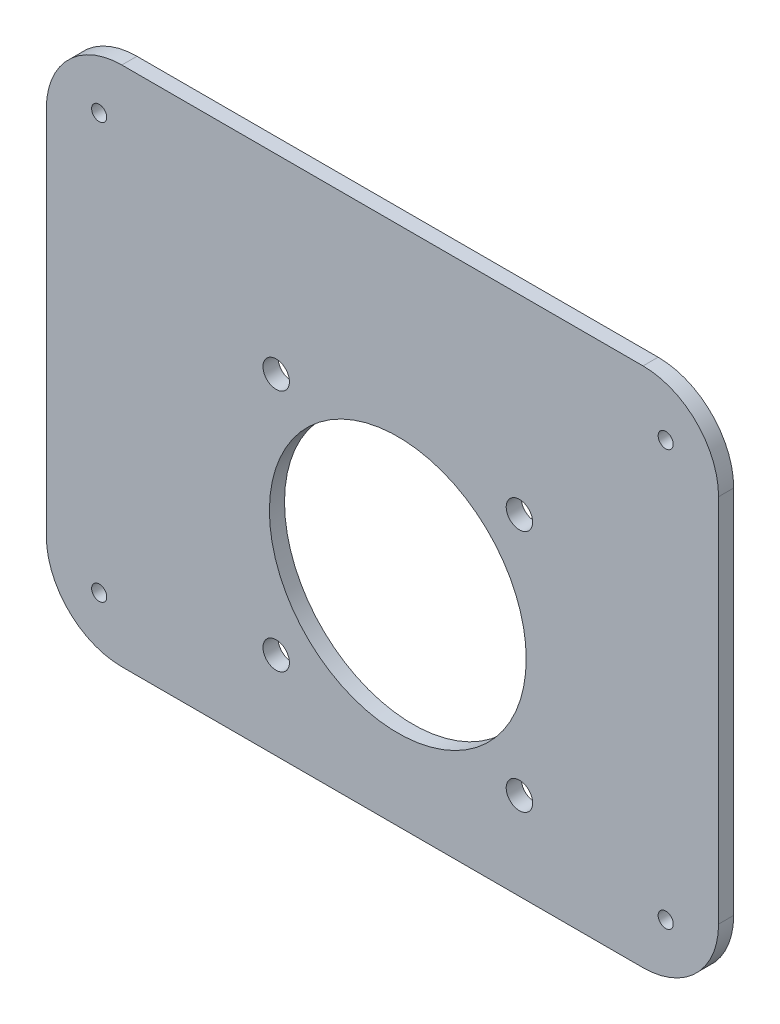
ISO-10303-21;
HEADER;
FILE_DESCRIPTION(('STEP AP214'),'2;1');
FILE_NAME('part.step','',(''),(''),'','','');
FILE_SCHEMA(('AUTOMOTIVE_DESIGN { 1 0 10303 214 1 1 1 1 }'));
ENDSEC;
DATA;
#1=APPLICATION_CONTEXT('core data for automotive mechanical design processes');
#2=APPLICATION_PROTOCOL_DEFINITION('international standard','automotive_design',2000,#1);
#3=PRODUCT_CONTEXT('',#1,'mechanical');
#4=PRODUCT('Part','Part','',(#3));
#5=PRODUCT_RELATED_PRODUCT_CATEGORY('part','',(#4));
#6=PRODUCT_DEFINITION_FORMATION('','',#4);
#7=PRODUCT_DEFINITION_CONTEXT('part definition',#1,'design');
#8=PRODUCT_DEFINITION('design','',#6,#7);
#9=PRODUCT_DEFINITION_SHAPE('','',#8);
#10=(LENGTH_UNIT() NAMED_UNIT(*) SI_UNIT(.MILLI.,.METRE.));
#11=(NAMED_UNIT(*) PLANE_ANGLE_UNIT() SI_UNIT($,.RADIAN.));
#12=(NAMED_UNIT(*) SI_UNIT($,.STERADIAN.) SOLID_ANGLE_UNIT());
#13=UNCERTAINTY_MEASURE_WITH_UNIT(LENGTH_MEASURE(1.E-05),#10,'distance_accuracy_value','');
#14=(GEOMETRIC_REPRESENTATION_CONTEXT(3) GLOBAL_UNCERTAINTY_ASSIGNED_CONTEXT((#13)) GLOBAL_UNIT_ASSIGNED_CONTEXT((#10,
#11,#12)) REPRESENTATION_CONTEXT('',''));
#15=CARTESIAN_POINT('',(0.,0.,0.));
#16=DIRECTION('',(0.,0.,1.));
#17=DIRECTION('',(1.,0.,0.));
#18=AXIS2_PLACEMENT_3D('',#15,#16,#17);
#19=CARTESIAN_POINT('',(79.,-59.,-2.));
#20=DIRECTION('',(0.,0.,1.));
#21=DIRECTION('',(1.,0.,0.));
#22=AXIS2_PLACEMENT_3D('',#19,#20,#21);
#23=CYLINDRICAL_SURFACE('',#22,9.99999999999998);
#24=CARTESIAN_POINT('',(79.,-59.,0.));
#25=DIRECTION('',(0.,0.,1.));
#26=DIRECTION('',(1.,0.,0.));
#27=AXIS2_PLACEMENT_3D('',#24,#25,#26);
#28=CIRCLE('',#27,9.99999999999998);
#29=CARTESIAN_POINT('',(79.,-69.,0.));
#30=VERTEX_POINT('',#29);
#31=CARTESIAN_POINT('',(89.,-59.,0.));
#32=VERTEX_POINT('',#31);
#33=EDGE_CURVE('E146',#30,#32,#28,.T.);
#34=ORIENTED_EDGE('',*,*,#33,.F.);
#35=DIRECTION('',(0.,0.,1.));
#36=VECTOR('',#35,1.);
#37=CARTESIAN_POINT('',(79.,-69.,-2.));
#38=LINE('',#37,#36);
#39=CARTESIAN_POINT('',(79.,-69.,-2.));
#40=VERTEX_POINT('',#39);
#41=EDGE_CURVE('E11',#40,#30,#38,.T.);
#42=ORIENTED_EDGE('',*,*,#41,.F.);
#43=CARTESIAN_POINT('',(79.,-59.,-2.));
#44=DIRECTION('',(0.,0.,1.));
#45=DIRECTION('',(1.,0.,0.));
#46=AXIS2_PLACEMENT_3D('',#43,#44,#45);
#47=CIRCLE('',#46,9.99999999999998);
#48=CARTESIAN_POINT('',(89.,-59.,-2.));
#49=VERTEX_POINT('',#48);
#50=EDGE_CURVE('E177',#40,#49,#47,.T.);
#51=ORIENTED_EDGE('',*,*,#50,.T.);
#52=DIRECTION('',(0.,0.,1.));
#53=VECTOR('',#52,1.);
#54=CARTESIAN_POINT('',(89.,-59.,-2.));
#55=LINE('',#54,#53);
#56=EDGE_CURVE('E40',#49,#32,#55,.T.);
#57=ORIENTED_EDGE('',*,*,#56,.T.);
#58=EDGE_LOOP('',(#34,#42,#51,#57));
#59=FACE_BOUND('',#58,.T.);
#60=ADVANCED_FACE('F37',(#59),#23,.T.);
#61=CARTESIAN_POINT('',(0.,-69.,-2.));
#62=DIRECTION('',(0.,-1.,0.));
#63=DIRECTION('',(0.,0.,-1.));
#64=AXIS2_PLACEMENT_3D('',#61,#62,#63);
#65=PLANE('',#64);
#66=DIRECTION('',(1.,0.,0.));
#67=VECTOR('',#66,1.);
#68=CARTESIAN_POINT('',(0.,-69.,0.));
#69=LINE('',#68,#67);
#70=CARTESIAN_POINT('',(10.0000000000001,-69.,0.));
#71=VERTEX_POINT('',#70);
#72=EDGE_CURVE('E163',#71,#30,#69,.T.);
#73=ORIENTED_EDGE('',*,*,#72,.F.);
#74=DIRECTION('',(0.,0.,1.));
#75=VECTOR('',#74,1.);
#76=CARTESIAN_POINT('',(10.0000000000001,-69.,-2.));
#77=LINE('',#76,#75);
#78=CARTESIAN_POINT('',(10.0000000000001,-69.,-2.));
#79=VERTEX_POINT('',#78);
#80=EDGE_CURVE('E46',#79,#71,#77,.T.);
#81=ORIENTED_EDGE('',*,*,#80,.F.);
#82=DIRECTION('',(1.,0.,0.));
#83=VECTOR('',#82,1.);
#84=CARTESIAN_POINT('',(0.,-69.,-2.));
#85=LINE('',#84,#83);
#86=EDGE_CURVE('E124',#79,#40,#85,.T.);
#87=ORIENTED_EDGE('',*,*,#86,.T.);
#88=ORIENTED_EDGE('',*,*,#41,.T.);
#89=EDGE_LOOP('',(#73,#81,#87,#88));
#90=FACE_BOUND('',#89,.T.);
#91=ADVANCED_FACE('F195',(#90),#65,.T.);
#92=CARTESIAN_POINT('',(10.,-59.,-2.));
#93=DIRECTION('',(0.,0.,1.));
#94=DIRECTION('',(1.,0.,0.));
#95=AXIS2_PLACEMENT_3D('',#92,#93,#94);
#96=CYLINDRICAL_SURFACE('',#95,10.);
#97=CARTESIAN_POINT('',(10.,-59.,0.));
#98=DIRECTION('',(0.,0.,1.));
#99=DIRECTION('',(1.,0.,0.));
#100=AXIS2_PLACEMENT_3D('',#97,#98,#99);
#101=CIRCLE('',#100,10.);
#102=CARTESIAN_POINT('',(0.,-58.9999999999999,0.));
#103=VERTEX_POINT('',#102);
#104=EDGE_CURVE('E111',#103,#71,#101,.T.);
#105=ORIENTED_EDGE('',*,*,#104,.F.);
#106=DIRECTION('',(0.,0.,1.));
#107=VECTOR('',#106,1.);
#108=CARTESIAN_POINT('',(0.,-58.9999999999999,-2.));
#109=LINE('',#108,#107);
#110=CARTESIAN_POINT('',(0.,-58.9999999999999,-2.));
#111=VERTEX_POINT('',#110);
#112=EDGE_CURVE('E106',#111,#103,#109,.T.);
#113=ORIENTED_EDGE('',*,*,#112,.F.);
#114=CARTESIAN_POINT('',(10.,-59.,-2.));
#115=DIRECTION('',(0.,0.,1.));
#116=DIRECTION('',(1.,0.,0.));
#117=AXIS2_PLACEMENT_3D('',#114,#115,#116);
#118=CIRCLE('',#117,10.);
#119=EDGE_CURVE('E109',#111,#79,#118,.T.);
#120=ORIENTED_EDGE('',*,*,#119,.T.);
#121=ORIENTED_EDGE('',*,*,#80,.T.);
#122=EDGE_LOOP('',(#105,#113,#120,#121));
#123=FACE_BOUND('',#122,.T.);
#124=ADVANCED_FACE('F108',(#123),#96,.T.);
#125=CARTESIAN_POINT('',(0.,0.,-2.));
#126=DIRECTION('',(-1.,0.,0.));
#127=DIRECTION('',(0.,-1.,0.));
#128=AXIS2_PLACEMENT_3D('',#125,#126,#127);
#129=PLANE('',#128);
#130=DIRECTION('',(0.,-1.,0.));
#131=VECTOR('',#130,1.);
#132=CARTESIAN_POINT('',(0.,0.,0.));
#133=LINE('',#132,#131);
#134=CARTESIAN_POINT('',(0.,-10.0000000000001,0.));
#135=VERTEX_POINT('',#134);
#136=EDGE_CURVE('E160',#135,#103,#133,.T.);
#137=ORIENTED_EDGE('',*,*,#136,.F.);
#138=DIRECTION('',(0.,0.,1.));
#139=VECTOR('',#138,1.);
#140=CARTESIAN_POINT('',(0.,-10.0000000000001,-2.));
#141=LINE('',#140,#139);
#142=CARTESIAN_POINT('',(0.,-10.0000000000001,-2.));
#143=VERTEX_POINT('',#142);
#144=EDGE_CURVE('E116',#143,#135,#141,.T.);
#145=ORIENTED_EDGE('',*,*,#144,.F.);
#146=DIRECTION('',(0.,-1.,0.));
#147=VECTOR('',#146,1.);
#148=CARTESIAN_POINT('',(0.,0.,-2.));
#149=LINE('',#148,#147);
#150=EDGE_CURVE('E122',#143,#111,#149,.T.);
#151=ORIENTED_EDGE('',*,*,#150,.T.);
#152=ORIENTED_EDGE('',*,*,#112,.T.);
#153=EDGE_LOOP('',(#137,#145,#151,#152));
#154=FACE_BOUND('',#153,.T.);
#155=ADVANCED_FACE('F126',(#154),#129,.T.);
#156=CARTESIAN_POINT('',(10.,-10.,-2.));
#157=DIRECTION('',(0.,0.,1.));
#158=DIRECTION('',(1.,0.,0.));
#159=AXIS2_PLACEMENT_3D('',#156,#157,#158);
#160=CYLINDRICAL_SURFACE('',#159,10.);
#161=CARTESIAN_POINT('',(10.,-10.,0.));
#162=DIRECTION('',(0.,0.,1.));
#163=DIRECTION('',(1.,0.,0.));
#164=AXIS2_PLACEMENT_3D('',#161,#162,#163);
#165=CIRCLE('',#164,10.);
#166=CARTESIAN_POINT('',(10.0000000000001,0.,0.));
#167=VERTEX_POINT('',#166);
#168=EDGE_CURVE('E157',#167,#135,#165,.T.);
#169=ORIENTED_EDGE('',*,*,#168,.F.);
#170=DIRECTION('',(0.,0.,1.));
#171=VECTOR('',#170,1.);
#172=CARTESIAN_POINT('',(10.0000000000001,0.,-2.));
#173=LINE('',#172,#171);
#174=CARTESIAN_POINT('',(10.0000000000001,0.,-2.));
#175=VERTEX_POINT('',#174);
#176=EDGE_CURVE('E181',#175,#167,#173,.T.);
#177=ORIENTED_EDGE('',*,*,#176,.F.);
#178=CARTESIAN_POINT('',(10.,-10.,-2.));
#179=DIRECTION('',(0.,0.,1.));
#180=DIRECTION('',(1.,0.,0.));
#181=AXIS2_PLACEMENT_3D('',#178,#179,#180);
#182=CIRCLE('',#181,10.);
#183=EDGE_CURVE('E127',#175,#143,#182,.T.);
#184=ORIENTED_EDGE('',*,*,#183,.T.);
#185=ORIENTED_EDGE('',*,*,#144,.T.);
#186=EDGE_LOOP('',(#169,#177,#184,#185));
#187=FACE_BOUND('',#186,.T.);
#188=ADVANCED_FACE('F209',(#187),#160,.T.);
#189=CARTESIAN_POINT('',(0.,0.,-2.));
#190=DIRECTION('',(0.,-1.,0.));
#191=DIRECTION('',(1.,0.,0.));
#192=AXIS2_PLACEMENT_3D('',#189,#190,#191);
#193=PLANE('',#192);
#194=DIRECTION('',(1.,0.,0.));
#195=VECTOR('',#194,1.);
#196=CARTESIAN_POINT('',(0.,0.,0.));
#197=LINE('',#196,#195);
#198=CARTESIAN_POINT('',(79.,0.,0.));
#199=VERTEX_POINT('',#198);
#200=EDGE_CURVE('E155',#167,#199,#197,.T.);
#201=ORIENTED_EDGE('',*,*,#200,.T.);
#202=DIRECTION('',(0.,0.,1.));
#203=VECTOR('',#202,1.);
#204=CARTESIAN_POINT('',(79.,0.,-2.));
#205=LINE('',#204,#203);
#206=CARTESIAN_POINT('',(79.,0.,-2.));
#207=VERTEX_POINT('',#206);
#208=EDGE_CURVE('E183',#207,#199,#205,.T.);
#209=ORIENTED_EDGE('',*,*,#208,.F.);
#210=DIRECTION('',(1.,0.,0.));
#211=VECTOR('',#210,1.);
#212=CARTESIAN_POINT('',(0.,0.,-2.));
#213=LINE('',#212,#211);
#214=EDGE_CURVE('E129',#175,#207,#213,.T.);
#215=ORIENTED_EDGE('',*,*,#214,.F.);
#216=ORIENTED_EDGE('',*,*,#176,.T.);
#217=EDGE_LOOP('',(#201,#209,#215,#216));
#218=FACE_BOUND('',#217,.T.);
#219=ADVANCED_FACE('F212',(#218),#193,.F.);
#220=CARTESIAN_POINT('',(79.,-10.,-2.));
#221=DIRECTION('',(0.,0.,1.));
#222=DIRECTION('',(1.,0.,0.));
#223=AXIS2_PLACEMENT_3D('',#220,#221,#222);
#224=CYLINDRICAL_SURFACE('',#223,9.99999999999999);
#225=CARTESIAN_POINT('',(79.,-10.,0.));
#226=DIRECTION('',(0.,0.,1.));
#227=DIRECTION('',(1.,0.,0.));
#228=AXIS2_PLACEMENT_3D('',#225,#226,#227);
#229=CIRCLE('',#228,9.99999999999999);
#230=CARTESIAN_POINT('',(89.,-10.,0.));
#231=VERTEX_POINT('',#230);
#232=EDGE_CURVE('E153',#199,#231,#229,.F.);
#233=ORIENTED_EDGE('',*,*,#232,.T.);
#234=DIRECTION('',(0.,0.,1.));
#235=VECTOR('',#234,1.);
#236=CARTESIAN_POINT('',(89.,-10.,-2.));
#237=LINE('',#236,#235);
#238=CARTESIAN_POINT('',(89.,-10.,-2.));
#239=VERTEX_POINT('',#238);
#240=EDGE_CURVE('E185',#239,#231,#237,.T.);
#241=ORIENTED_EDGE('',*,*,#240,.F.);
#242=CARTESIAN_POINT('',(79.,-10.,-2.));
#243=DIRECTION('',(0.,0.,1.));
#244=DIRECTION('',(1.,0.,0.));
#245=AXIS2_PLACEMENT_3D('',#242,#243,#244);
#246=CIRCLE('',#245,9.99999999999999);
#247=EDGE_CURVE('E315',#207,#239,#246,.F.);
#248=ORIENTED_EDGE('',*,*,#247,.F.);
#249=ORIENTED_EDGE('',*,*,#208,.T.);
#250=EDGE_LOOP('',(#233,#241,#248,#249));
#251=FACE_BOUND('',#250,.T.);
#252=ADVANCED_FACE('F216',(#251),#224,.T.);
#253=CARTESIAN_POINT('',(82.,-7.00000000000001,-2.));
#254=DIRECTION('',(0.,0.,1.));
#255=DIRECTION('',(1.,0.,0.));
#256=AXIS2_PLACEMENT_3D('',#253,#254,#255);
#257=CYLINDRICAL_SURFACE('',#256,0.999999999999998);
#258=CARTESIAN_POINT('',(82.,-7.00000000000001,-2.));
#259=DIRECTION('',(0.,0.,1.));
#260=DIRECTION('',(1.,0.,0.));
#261=AXIS2_PLACEMENT_3D('',#258,#259,#260);
#262=CIRCLE('',#261,0.999999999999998);
#263=CARTESIAN_POINT('',(83.,-7.00000000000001,-2.));
#264=VERTEX_POINT('',#263);
#265=EDGE_CURVE('E140',#264,#264,#262,.F.);
#266=ORIENTED_EDGE('',*,*,#265,.T.);
#267=EDGE_LOOP('',(#266));
#268=FACE_BOUND('',#267,.T.);
#269=CARTESIAN_POINT('',(82.,-7.00000000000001,0.));
#270=DIRECTION('',(0.,0.,1.));
#271=DIRECTION('',(1.,0.,0.));
#272=AXIS2_PLACEMENT_3D('',#269,#270,#271);
#273=CIRCLE('',#272,0.999999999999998);
#274=CARTESIAN_POINT('',(83.,-7.00000000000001,0.));
#275=VERTEX_POINT('',#274);
#276=EDGE_CURVE('E172',#275,#275,#273,.F.);
#277=ORIENTED_EDGE('',*,*,#276,.F.);
#278=EDGE_LOOP('',(#277));
#279=FACE_BOUND('',#278,.T.);
#280=ADVANCED_FACE('F219',(#268,#279),#257,.F.);
#281=CARTESIAN_POINT('',(7.,-62.,-2.));
#282=DIRECTION('',(0.,0.,1.));
#283=DIRECTION('',(1.,0.,0.));
#284=AXIS2_PLACEMENT_3D('',#281,#282,#283);
#285=CYLINDRICAL_SURFACE('',#284,1.);
#286=CARTESIAN_POINT('',(7.,-62.,-2.));
#287=DIRECTION('',(0.,0.,1.));
#288=DIRECTION('',(1.,0.,0.));
#289=AXIS2_PLACEMENT_3D('',#286,#287,#288);
#290=CIRCLE('',#289,1.);
#291=CARTESIAN_POINT('',(8.,-62.,-2.));
#292=VERTEX_POINT('',#291);
#293=EDGE_CURVE('E137',#292,#292,#290,.F.);
#294=ORIENTED_EDGE('',*,*,#293,.T.);
#295=EDGE_LOOP('',(#294));
#296=FACE_BOUND('',#295,.T.);
#297=CARTESIAN_POINT('',(7.,-62.,0.));
#298=DIRECTION('',(0.,0.,1.));
#299=DIRECTION('',(1.,0.,0.));
#300=AXIS2_PLACEMENT_3D('',#297,#298,#299);
#301=CIRCLE('',#300,1.);
#302=CARTESIAN_POINT('',(8.,-62.,0.));
#303=VERTEX_POINT('',#302);
#304=EDGE_CURVE('E169',#303,#303,#301,.F.);
#305=ORIENTED_EDGE('',*,*,#304,.F.);
#306=EDGE_LOOP('',(#305));
#307=FACE_BOUND('',#306,.T.);
#308=ADVANCED_FACE('F229',(#296,#307),#285,.F.);
#309=CARTESIAN_POINT('',(7.,-7.,-2.));
#310=DIRECTION('',(0.,0.,1.));
#311=DIRECTION('',(1.,0.,0.));
#312=AXIS2_PLACEMENT_3D('',#309,#310,#311);
#313=CYLINDRICAL_SURFACE('',#312,1.);
#314=CARTESIAN_POINT('',(7.,-7.,-2.));
#315=DIRECTION('',(0.,0.,1.));
#316=DIRECTION('',(1.,0.,0.));
#317=AXIS2_PLACEMENT_3D('',#314,#315,#316);
#318=CIRCLE('',#317,1.);
#319=CARTESIAN_POINT('',(8.,-7.,-2.));
#320=VERTEX_POINT('',#319);
#321=EDGE_CURVE('E134',#320,#320,#318,.T.);
#322=ORIENTED_EDGE('',*,*,#321,.F.);
#323=EDGE_LOOP('',(#322));
#324=FACE_BOUND('',#323,.T.);
#325=CARTESIAN_POINT('',(7.,-7.,0.));
#326=DIRECTION('',(0.,0.,1.));
#327=DIRECTION('',(1.,0.,0.));
#328=AXIS2_PLACEMENT_3D('',#325,#326,#327);
#329=CIRCLE('',#328,1.);
#330=CARTESIAN_POINT('',(8.,-7.,0.));
#331=VERTEX_POINT('',#330);
#332=EDGE_CURVE('E166',#331,#331,#329,.T.);
#333=ORIENTED_EDGE('',*,*,#332,.T.);
#334=EDGE_LOOP('',(#333));
#335=FACE_BOUND('',#334,.T.);
#336=ADVANCED_FACE('F204',(#324,#335),#313,.F.);
#337=CARTESIAN_POINT('',(89.,0.,-2.));
#338=DIRECTION('',(-1.,0.,0.));
#339=DIRECTION('',(0.,0.,1.));
#340=AXIS2_PLACEMENT_3D('',#337,#338,#339);
#341=PLANE('',#340);
#342=DIRECTION('',(0.,-1.,0.));
#343=VECTOR('',#342,1.);
#344=CARTESIAN_POINT('',(89.,0.,0.));
#345=LINE('',#344,#343);
#346=EDGE_CURVE('E149',#231,#32,#345,.T.);
#347=ORIENTED_EDGE('',*,*,#346,.T.);
#348=ORIENTED_EDGE('',*,*,#56,.F.);
#349=DIRECTION('',(0.,-1.,0.));
#350=VECTOR('',#349,1.);
#351=CARTESIAN_POINT('',(89.,0.,-2.));
#352=LINE('',#351,#350);
#353=EDGE_CURVE('E93',#239,#49,#352,.T.);
#354=ORIENTED_EDGE('',*,*,#353,.F.);
#355=ORIENTED_EDGE('',*,*,#240,.T.);
#356=EDGE_LOOP('',(#347,#348,#354,#355));
#357=FACE_BOUND('',#356,.T.);
#358=ADVANCED_FACE('F190',(#357),#341,.F.);
#359=CARTESIAN_POINT('',(82.,-62.,-2.));
#360=DIRECTION('',(0.,0.,1.));
#361=DIRECTION('',(1.,0.,0.));
#362=AXIS2_PLACEMENT_3D('',#359,#360,#361);
#363=CYLINDRICAL_SURFACE('',#362,0.999999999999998);
#364=CARTESIAN_POINT('',(82.,-62.,-2.));
#365=DIRECTION('',(0.,0.,1.));
#366=DIRECTION('',(1.,0.,0.));
#367=AXIS2_PLACEMENT_3D('',#364,#365,#366);
#368=CIRCLE('',#367,0.999999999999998);
#369=CARTESIAN_POINT('',(83.,-62.,-2.));
#370=VERTEX_POINT('',#369);
#371=EDGE_CURVE('E143',#370,#370,#368,.T.);
#372=ORIENTED_EDGE('',*,*,#371,.F.);
#373=EDGE_LOOP('',(#372));
#374=FACE_BOUND('',#373,.T.);
#375=CARTESIAN_POINT('',(82.,-62.,0.));
#376=DIRECTION('',(0.,0.,1.));
#377=DIRECTION('',(1.,0.,0.));
#378=AXIS2_PLACEMENT_3D('',#375,#376,#377);
#379=CIRCLE('',#378,0.999999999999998);
#380=CARTESIAN_POINT('',(83.,-62.,0.));
#381=VERTEX_POINT('',#380);
#382=EDGE_CURVE('E175',#381,#381,#379,.T.);
#383=ORIENTED_EDGE('',*,*,#382,.T.);
#384=EDGE_LOOP('',(#383));
#385=FACE_BOUND('',#384,.T.);
#386=ADVANCED_FACE('F222',(#374,#385),#363,.F.);
#387=CARTESIAN_POINT('',(0.,0.,-2.));
#388=DIRECTION('',(0.,0.,1.));
#389=DIRECTION('',(1.,0.,0.));
#390=AXIS2_PLACEMENT_3D('',#387,#388,#389);
#391=PLANE('',#390);
#392=CARTESIAN_POINT('',(46.533894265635,-41.3307542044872,-2.));
#393=DIRECTION('',(0.,0.,1.));
#394=DIRECTION('',(1.,0.,0.));
#395=AXIS2_PLACEMENT_3D('',#392,#393,#394);
#396=CIRCLE('',#395,17.0000000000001);
#397=CARTESIAN_POINT('',(63.5338942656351,-41.3307542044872,-2.));
#398=VERTEX_POINT('',#397);
#399=EDGE_CURVE('E290',#398,#398,#396,.F.);
#400=ORIENTED_EDGE('',*,*,#399,.F.);
#401=EDGE_LOOP('',(#400));
#402=FACE_BOUND('',#401,.T.);
#403=CARTESIAN_POINT('',(62.633894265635,-25.2307542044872,-2.));
#404=DIRECTION('',(0.,0.,1.));
#405=DIRECTION('',(1.,0.,0.));
#406=AXIS2_PLACEMENT_3D('',#403,#404,#405);
#407=CIRCLE('',#406,1.75);
#408=CARTESIAN_POINT('',(64.383894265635,-25.2307542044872,-2.));
#409=VERTEX_POINT('',#408);
#410=EDGE_CURVE('E305',#409,#409,#407,.F.);
#411=ORIENTED_EDGE('',*,*,#410,.F.);
#412=EDGE_LOOP('',(#411));
#413=FACE_BOUND('',#412,.T.);
#414=CARTESIAN_POINT('',(30.433894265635,-57.4307542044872,-2.));
#415=DIRECTION('',(0.,0.,1.));
#416=DIRECTION('',(1.,0.,0.));
#417=AXIS2_PLACEMENT_3D('',#414,#415,#416);
#418=CIRCLE('',#417,1.75);
#419=CARTESIAN_POINT('',(32.183894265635,-57.4307542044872,-2.));
#420=VERTEX_POINT('',#419);
#421=EDGE_CURVE('E285',#420,#420,#418,.F.);
#422=ORIENTED_EDGE('',*,*,#421,.F.);
#423=EDGE_LOOP('',(#422));
#424=FACE_BOUND('',#423,.T.);
#425=CARTESIAN_POINT('',(62.633894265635,-57.4307542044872,-2.));
#426=DIRECTION('',(0.,0.,1.));
#427=DIRECTION('',(1.,0.,0.));
#428=AXIS2_PLACEMENT_3D('',#425,#426,#427);
#429=CIRCLE('',#428,1.75);
#430=CARTESIAN_POINT('',(64.383894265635,-57.4307542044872,-2.));
#431=VERTEX_POINT('',#430);
#432=EDGE_CURVE('E292',#431,#431,#429,.F.);
#433=ORIENTED_EDGE('',*,*,#432,.F.);
#434=EDGE_LOOP('',(#433));
#435=FACE_BOUND('',#434,.T.);
#436=CARTESIAN_POINT('',(30.433894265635,-25.2307542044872,-2.));
#437=DIRECTION('',(0.,0.,1.));
#438=DIRECTION('',(1.,0.,0.));
#439=AXIS2_PLACEMENT_3D('',#436,#437,#438);
#440=CIRCLE('',#439,1.75);
#441=CARTESIAN_POINT('',(32.183894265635,-25.2307542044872,-2.));
#442=VERTEX_POINT('',#441);
#443=EDGE_CURVE('E150',#442,#442,#440,.F.);
#444=ORIENTED_EDGE('',*,*,#443,.F.);
#445=EDGE_LOOP('',(#444));
#446=FACE_BOUND('',#445,.T.);
#447=ORIENTED_EDGE('',*,*,#50,.F.);
#448=ORIENTED_EDGE('',*,*,#86,.F.);
#449=ORIENTED_EDGE('',*,*,#119,.F.);
#450=ORIENTED_EDGE('',*,*,#150,.F.);
#451=ORIENTED_EDGE('',*,*,#183,.F.);
#452=ORIENTED_EDGE('',*,*,#214,.T.);
#453=ORIENTED_EDGE('',*,*,#247,.T.);
#454=ORIENTED_EDGE('',*,*,#353,.T.);
#455=EDGE_LOOP('',(#447,#448,#449,#450,#451,#452,#453,#454));
#456=FACE_BOUND('',#455,.T.);
#457=ORIENTED_EDGE('',*,*,#321,.T.);
#458=EDGE_LOOP('',(#457));
#459=FACE_BOUND('',#458,.T.);
#460=ORIENTED_EDGE('',*,*,#293,.F.);
#461=EDGE_LOOP('',(#460));
#462=FACE_BOUND('',#461,.T.);
#463=ORIENTED_EDGE('',*,*,#265,.F.);
#464=EDGE_LOOP('',(#463));
#465=FACE_BOUND('',#464,.T.);
#466=ORIENTED_EDGE('',*,*,#371,.T.);
#467=EDGE_LOOP('',(#466));
#468=FACE_BOUND('',#467,.T.);
#469=ADVANCED_FACE('F119',(#402,#413,#424,#435,#446,#456,#459,#462,#465,#468),#391,.F.);
#470=CARTESIAN_POINT('',(0.,0.,0.));
#471=DIRECTION('',(0.,0.,1.));
#472=DIRECTION('',(1.,0.,0.));
#473=AXIS2_PLACEMENT_3D('',#470,#471,#472);
#474=PLANE('',#473);
#475=CARTESIAN_POINT('',(46.533894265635,-41.3307542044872,0.));
#476=DIRECTION('',(0.,0.,1.));
#477=DIRECTION('',(1.,0.,0.));
#478=AXIS2_PLACEMENT_3D('',#475,#476,#477);
#479=CIRCLE('',#478,17.0000000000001);
#480=CARTESIAN_POINT('',(63.5338942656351,-41.3307542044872,0.));
#481=VERTEX_POINT('',#480);
#482=EDGE_CURVE('E287',#481,#481,#479,.T.);
#483=ORIENTED_EDGE('',*,*,#482,.F.);
#484=EDGE_LOOP('',(#483));
#485=FACE_BOUND('',#484,.T.);
#486=CARTESIAN_POINT('',(62.633894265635,-25.2307542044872,0.));
#487=DIRECTION('',(0.,0.,1.));
#488=DIRECTION('',(1.,0.,0.));
#489=AXIS2_PLACEMENT_3D('',#486,#487,#488);
#490=CIRCLE('',#489,1.75);
#491=CARTESIAN_POINT('',(64.383894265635,-25.2307542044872,0.));
#492=VERTEX_POINT('',#491);
#493=EDGE_CURVE('E302',#492,#492,#490,.T.);
#494=ORIENTED_EDGE('',*,*,#493,.F.);
#495=EDGE_LOOP('',(#494));
#496=FACE_BOUND('',#495,.T.);
#497=CARTESIAN_POINT('',(30.433894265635,-57.4307542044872,0.));
#498=DIRECTION('',(0.,0.,1.));
#499=DIRECTION('',(1.,0.,0.));
#500=AXIS2_PLACEMENT_3D('',#497,#498,#499);
#501=CIRCLE('',#500,1.75);
#502=CARTESIAN_POINT('',(32.183894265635,-57.4307542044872,0.));
#503=VERTEX_POINT('',#502);
#504=EDGE_CURVE('E282',#503,#503,#501,.T.);
#505=ORIENTED_EDGE('',*,*,#504,.F.);
#506=EDGE_LOOP('',(#505));
#507=FACE_BOUND('',#506,.T.);
#508=CARTESIAN_POINT('',(62.633894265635,-57.4307542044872,0.));
#509=DIRECTION('',(0.,0.,1.));
#510=DIRECTION('',(1.,0.,0.));
#511=AXIS2_PLACEMENT_3D('',#508,#509,#510);
#512=CIRCLE('',#511,1.75);
#513=CARTESIAN_POINT('',(64.383894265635,-57.4307542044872,0.));
#514=VERTEX_POINT('',#513);
#515=EDGE_CURVE('E295',#514,#514,#512,.T.);
#516=ORIENTED_EDGE('',*,*,#515,.F.);
#517=EDGE_LOOP('',(#516));
#518=FACE_BOUND('',#517,.T.);
#519=CARTESIAN_POINT('',(30.433894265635,-25.2307542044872,0.));
#520=DIRECTION('',(0.,0.,1.));
#521=DIRECTION('',(1.,0.,0.));
#522=AXIS2_PLACEMENT_3D('',#519,#520,#521);
#523=CIRCLE('',#522,1.75);
#524=CARTESIAN_POINT('',(32.183894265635,-25.2307542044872,0.));
#525=VERTEX_POINT('',#524);
#526=EDGE_CURVE('E308',#525,#525,#523,.T.);
#527=ORIENTED_EDGE('',*,*,#526,.F.);
#528=EDGE_LOOP('',(#527));
#529=FACE_BOUND('',#528,.T.);
#530=ORIENTED_EDGE('',*,*,#33,.T.);
#531=ORIENTED_EDGE('',*,*,#346,.F.);
#532=ORIENTED_EDGE('',*,*,#232,.F.);
#533=ORIENTED_EDGE('',*,*,#200,.F.);
#534=ORIENTED_EDGE('',*,*,#168,.T.);
#535=ORIENTED_EDGE('',*,*,#136,.T.);
#536=ORIENTED_EDGE('',*,*,#104,.T.);
#537=ORIENTED_EDGE('',*,*,#72,.T.);
#538=EDGE_LOOP('',(#530,#531,#532,#533,#534,#535,#536,#537));
#539=FACE_BOUND('',#538,.T.);
#540=ORIENTED_EDGE('',*,*,#332,.F.);
#541=EDGE_LOOP('',(#540));
#542=FACE_BOUND('',#541,.T.);
#543=ORIENTED_EDGE('',*,*,#304,.T.);
#544=EDGE_LOOP('',(#543));
#545=FACE_BOUND('',#544,.T.);
#546=ORIENTED_EDGE('',*,*,#276,.T.);
#547=EDGE_LOOP('',(#546));
#548=FACE_BOUND('',#547,.T.);
#549=ORIENTED_EDGE('',*,*,#382,.F.);
#550=EDGE_LOOP('',(#549));
#551=FACE_BOUND('',#550,.T.);
#552=ADVANCED_FACE('F193',(#485,#496,#507,#518,#529,#539,#542,#545,#548,#551),#474,.T.);
#553=CARTESIAN_POINT('',(30.433894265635,-25.2307542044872,-2.001));
#554=DIRECTION('',(0.,0.,1.));
#555=DIRECTION('',(1.,0.,0.));
#556=AXIS2_PLACEMENT_3D('',#553,#554,#555);
#557=CYLINDRICAL_SURFACE('',#556,1.75);
#558=ORIENTED_EDGE('',*,*,#526,.T.);
#559=EDGE_LOOP('',(#558));
#560=FACE_BOUND('',#559,.T.);
#561=ORIENTED_EDGE('',*,*,#443,.T.);
#562=EDGE_LOOP('',(#561));
#563=FACE_BOUND('',#562,.T.);
#564=ADVANCED_FACE('F240',(#560,#563),#557,.F.);
#565=CARTESIAN_POINT('',(62.633894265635,-57.4307542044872,-2.001));
#566=DIRECTION('',(0.,0.,1.));
#567=DIRECTION('',(1.,0.,0.));
#568=AXIS2_PLACEMENT_3D('',#565,#566,#567);
#569=CYLINDRICAL_SURFACE('',#568,1.75);
#570=ORIENTED_EDGE('',*,*,#515,.T.);
#571=EDGE_LOOP('',(#570));
#572=FACE_BOUND('',#571,.T.);
#573=ORIENTED_EDGE('',*,*,#432,.T.);
#574=EDGE_LOOP('',(#573));
#575=FACE_BOUND('',#574,.T.);
#576=ADVANCED_FACE('F261',(#572,#575),#569,.F.);
#577=CARTESIAN_POINT('',(30.433894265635,-57.4307542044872,-2.001));
#578=DIRECTION('',(0.,0.,1.));
#579=DIRECTION('',(1.,0.,0.));
#580=AXIS2_PLACEMENT_3D('',#577,#578,#579);
#581=CYLINDRICAL_SURFACE('',#580,1.75);
#582=ORIENTED_EDGE('',*,*,#504,.T.);
#583=EDGE_LOOP('',(#582));
#584=FACE_BOUND('',#583,.T.);
#585=ORIENTED_EDGE('',*,*,#421,.T.);
#586=EDGE_LOOP('',(#585));
#587=FACE_BOUND('',#586,.T.);
#588=ADVANCED_FACE('F267',(#584,#587),#581,.F.);
#589=CARTESIAN_POINT('',(62.633894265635,-25.2307542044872,-2.001));
#590=DIRECTION('',(0.,0.,1.));
#591=DIRECTION('',(1.,0.,0.));
#592=AXIS2_PLACEMENT_3D('',#589,#590,#591);
#593=CYLINDRICAL_SURFACE('',#592,1.75);
#594=ORIENTED_EDGE('',*,*,#493,.T.);
#595=EDGE_LOOP('',(#594));
#596=FACE_BOUND('',#595,.T.);
#597=ORIENTED_EDGE('',*,*,#410,.T.);
#598=EDGE_LOOP('',(#597));
#599=FACE_BOUND('',#598,.T.);
#600=ADVANCED_FACE('F263',(#596,#599),#593,.F.);
#601=CARTESIAN_POINT('',(46.533894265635,-41.3307542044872,-2.001));
#602=DIRECTION('',(0.,0.,1.));
#603=DIRECTION('',(1.,0.,0.));
#604=AXIS2_PLACEMENT_3D('',#601,#602,#603);
#605=CYLINDRICAL_SURFACE('',#604,17.0000000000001);
#606=ORIENTED_EDGE('',*,*,#482,.T.);
#607=EDGE_LOOP('',(#606));
#608=FACE_BOUND('',#607,.T.);
#609=ORIENTED_EDGE('',*,*,#399,.T.);
#610=EDGE_LOOP('',(#609));
#611=FACE_BOUND('',#610,.T.);
#612=ADVANCED_FACE('F266',(#608,#611),#605,.F.);
#613=CLOSED_SHELL('',(#60,#91,#124,#155,#188,#219,#252,#280,#308,#336,#358,#386,#469,#552,#564,
#576,#588,#600,#612));
#614=MANIFOLD_SOLID_BREP('B2',#613);
#615=ADVANCED_BREP_SHAPE_REPRESENTATION('',(#18,#614),#14);
#616=SHAPE_DEFINITION_REPRESENTATION(#9,#615);
ENDSEC;
END-ISO-10303-21;
